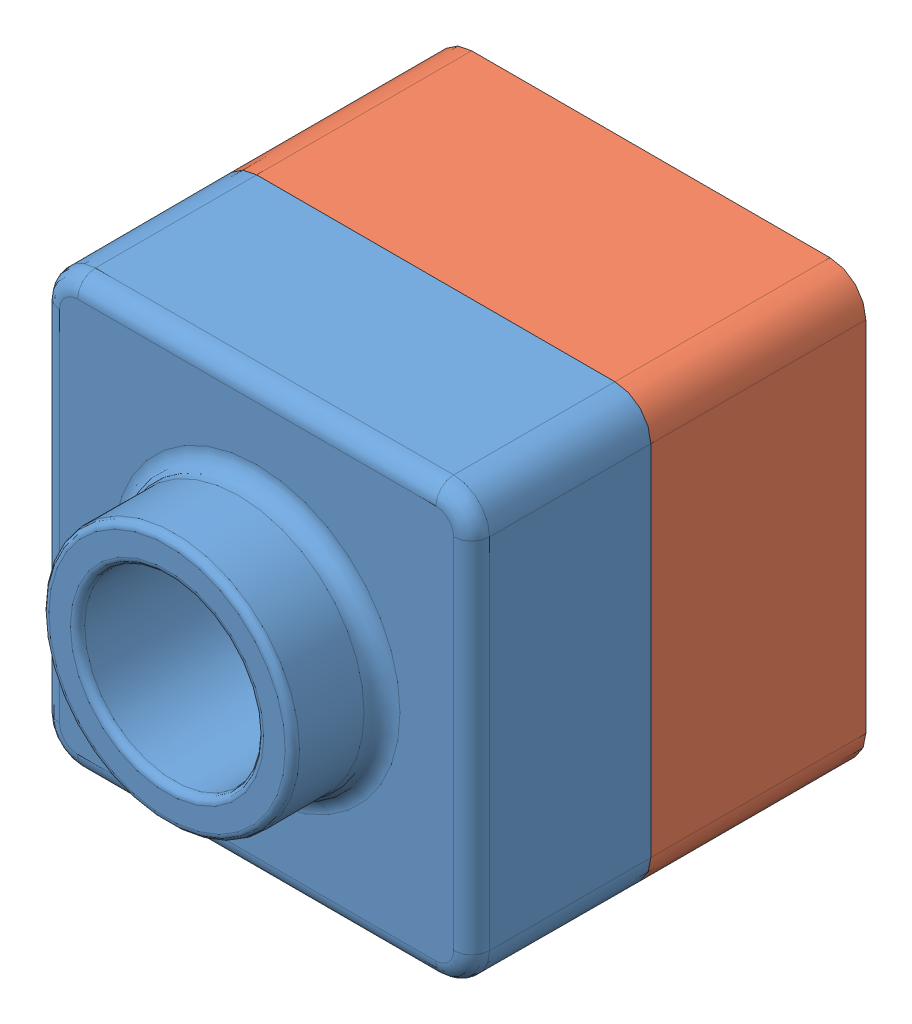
SolidWorks assembly Tutor.SLDASM, configuration Default (file format 4700). Lengths in mm.
Overall size (120 120 135).
2 component instances, 2 part files, 3 mates.
Components (placement in the parent):
- Tutor1-1: Tutor1.SLDPRT [Default] at origin size (120 120 75)
- Tutor2-1: Tutor2.SLDPRT [Default] at (0 0 -110) size (120 120 90)
Mates (geometry in assembly coordinates):
- Coincident1: coincident aligned: line of Tutor1-1 through (110 120 -50) axis (-1 0 0); line of Tutor2-1 through (110 120 -50) axis (-1 0 0)
- Coincident2: coincident aligned: plane of Tutor1-1 through (0 120 -50) normal (0 1 0); plane of Tutor2-1 through (0 120 -20) normal (0 1 0)
- Coincident3: coincident aligned: plane of Tutor1-1 through (120 0 -50) normal (1 0 0); plane of Tutor2-1 through (120 0 -20) normal (1 0 0)
